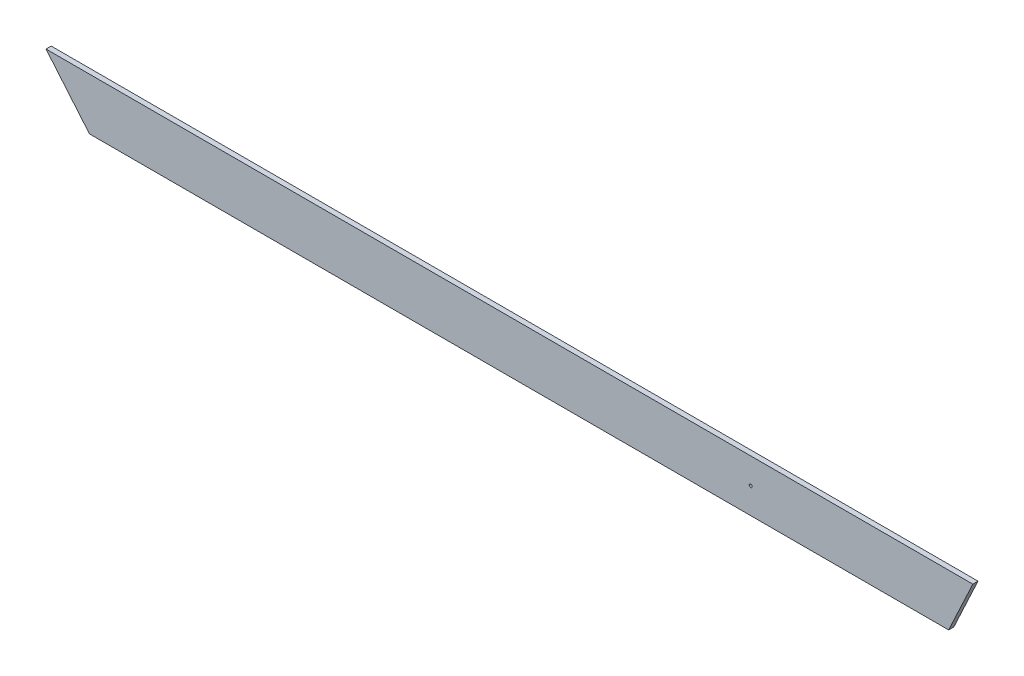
from build123d import *

# Parameters (mm, degrees)
BOSS_EXTRUDE1_DEPTH = 5
SKETCH2_R           = 1.5
CUT_EXTRUDE1_DEPTH  = 10


with BuildPart() as part:
    # Sketch1 → Boss-Extrude1 (new body)
    with BuildSketch(Plane.XY):
        Polygon((-405.545018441, 0), (424.184617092, 0), (447.5, 50), (-447.5, 50), align=None)
    extrude(amount=BOSS_EXTRUDE1_DEPTH)

    # Sketch2 → Cut-Extrude1 (cut)
    with BuildSketch(Plane.XY.offset(5)):
        with Locations((233, 25)):
            Circle(SKETCH2_R)
    extrude(amount=-CUT_EXTRUDE1_DEPTH, mode=Mode.SUBTRACT)


solid = part.part
